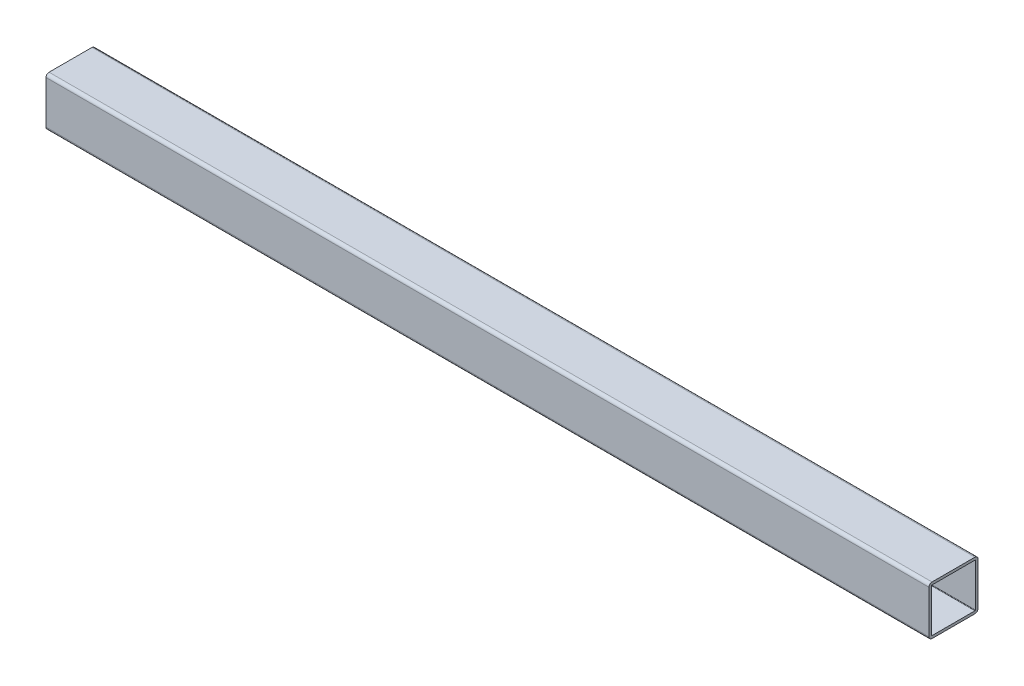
ISO-10303-21;
HEADER;
FILE_DESCRIPTION(('STEP AP214'),'2;1');
FILE_NAME('part.step','',(''),(''),'','','');
FILE_SCHEMA(('AUTOMOTIVE_DESIGN { 1 0 10303 214 1 1 1 1 }'));
ENDSEC;
DATA;
#1=APPLICATION_CONTEXT('core data for automotive mechanical design processes');
#2=APPLICATION_PROTOCOL_DEFINITION('international standard','automotive_design',2000,#1);
#3=PRODUCT_CONTEXT('',#1,'mechanical');
#4=PRODUCT('Part','Part','',(#3));
#5=PRODUCT_RELATED_PRODUCT_CATEGORY('part','',(#4));
#6=PRODUCT_DEFINITION_FORMATION('','',#4);
#7=PRODUCT_DEFINITION_CONTEXT('part definition',#1,'design');
#8=PRODUCT_DEFINITION('design','',#6,#7);
#9=PRODUCT_DEFINITION_SHAPE('','',#8);
#10=(LENGTH_UNIT() NAMED_UNIT(*) SI_UNIT(.MILLI.,.METRE.));
#11=(NAMED_UNIT(*) PLANE_ANGLE_UNIT() SI_UNIT($,.RADIAN.));
#12=(NAMED_UNIT(*) SI_UNIT($,.STERADIAN.) SOLID_ANGLE_UNIT());
#13=UNCERTAINTY_MEASURE_WITH_UNIT(LENGTH_MEASURE(1.E-05),#10,'distance_accuracy_value','');
#14=(GEOMETRIC_REPRESENTATION_CONTEXT(3) GLOBAL_UNCERTAINTY_ASSIGNED_CONTEXT((#13)) GLOBAL_UNIT_ASSIGNED_CONTEXT((#10,
#11,#12)) REPRESENTATION_CONTEXT('',''));
#15=CARTESIAN_POINT('',(0.,0.,0.));
#16=DIRECTION('',(0.,0.,1.));
#17=DIRECTION('',(1.,0.,0.));
#18=AXIS2_PLACEMENT_3D('',#15,#16,#17);
#19=CARTESIAN_POINT('',(457.2,3.65674086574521,-16.8519621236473));
#20=DIRECTION('',(-1.,0.,0.));
#21=DIRECTION('',(0.,0.,1.));
#22=AXIS2_PLACEMENT_3D('',#19,#20,#21);
#23=PLANE('',#22);
#24=CARTESIAN_POINT('',(457.2,3.65674086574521,-16.8519621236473));
#25=DIRECTION('',(1.,0.,0.));
#26=DIRECTION('',(0.,0.,1.));
#27=AXIS2_PLACEMENT_3D('',#24,#25,#26);
#28=CIRCLE('',#27,1.5875);
#29=CARTESIAN_POINT('',(457.2,3.6567408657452,-18.4394621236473));
#30=VERTEX_POINT('',#29);
#31=CARTESIAN_POINT('',(457.2,5.24424086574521,-16.8519621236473));
#32=VERTEX_POINT('',#31);
#33=EDGE_CURVE('E211',#30,#32,#28,.T.);
#34=ORIENTED_EDGE('',*,*,#33,.T.);
#35=DIRECTION('',(0.,0.,1.));
#36=VECTOR('',#35,1.);
#37=CARTESIAN_POINT('',(457.2,5.24424086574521,5.37303787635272));
#38=LINE('',#37,#36);
#39=CARTESIAN_POINT('',(457.2,5.24424086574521,5.37303787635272));
#40=VERTEX_POINT('',#39);
#41=EDGE_CURVE('E214',#32,#40,#38,.T.);
#42=ORIENTED_EDGE('',*,*,#41,.T.);
#43=CARTESIAN_POINT('',(457.2,3.65674086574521,5.37303787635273));
#44=DIRECTION('',(1.,0.,0.));
#45=DIRECTION('',(0.,0.,1.));
#46=AXIS2_PLACEMENT_3D('',#43,#44,#45);
#47=CIRCLE('',#46,1.5875);
#48=CARTESIAN_POINT('',(457.2,3.6567408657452,6.96053787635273));
#49=VERTEX_POINT('',#48);
#50=EDGE_CURVE('E217',#40,#49,#47,.T.);
#51=ORIENTED_EDGE('',*,*,#50,.T.);
#52=DIRECTION('',(0.,-1.,0.));
#53=VECTOR('',#52,1.);
#54=CARTESIAN_POINT('',(457.2,3.6567408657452,6.96053787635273));
#55=LINE('',#54,#53);
#56=CARTESIAN_POINT('',(457.2,-18.5682591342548,6.96053787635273));
#57=VERTEX_POINT('',#56);
#58=EDGE_CURVE('E219',#49,#57,#55,.T.);
#59=ORIENTED_EDGE('',*,*,#58,.T.);
#60=CARTESIAN_POINT('',(457.2,-18.5682591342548,5.37303787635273));
#61=DIRECTION('',(1.,0.,0.));
#62=DIRECTION('',(0.,0.,1.));
#63=AXIS2_PLACEMENT_3D('',#60,#61,#62);
#64=CIRCLE('',#63,1.5875);
#65=CARTESIAN_POINT('',(457.2,-20.1557591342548,5.37303787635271));
#66=VERTEX_POINT('',#65);
#67=EDGE_CURVE('E221',#57,#66,#64,.T.);
#68=ORIENTED_EDGE('',*,*,#67,.T.);
#69=DIRECTION('',(0.,0.,-1.));
#70=VECTOR('',#69,1.);
#71=CARTESIAN_POINT('',(457.2,-20.1557591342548,5.37303787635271));
#72=LINE('',#71,#70);
#73=CARTESIAN_POINT('',(457.2,-20.1557591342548,-16.8519621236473));
#74=VERTEX_POINT('',#73);
#75=EDGE_CURVE('E223',#66,#74,#72,.T.);
#76=ORIENTED_EDGE('',*,*,#75,.T.);
#77=CARTESIAN_POINT('',(457.2,-18.5682591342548,-16.8519621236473));
#78=DIRECTION('',(1.,0.,0.));
#79=DIRECTION('',(0.,0.,1.));
#80=AXIS2_PLACEMENT_3D('',#77,#78,#79);
#81=CIRCLE('',#80,1.5875);
#82=CARTESIAN_POINT('',(457.2,-18.5682591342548,-18.4394621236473));
#83=VERTEX_POINT('',#82);
#84=EDGE_CURVE('E225',#74,#83,#81,.T.);
#85=ORIENTED_EDGE('',*,*,#84,.T.);
#86=DIRECTION('',(0.,1.,0.));
#87=VECTOR('',#86,1.);
#88=CARTESIAN_POINT('',(457.2,3.6567408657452,-18.4394621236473));
#89=LINE('',#88,#87);
#90=EDGE_CURVE('E227',#83,#30,#89,.T.);
#91=ORIENTED_EDGE('',*,*,#90,.T.);
#92=EDGE_LOOP('',(#34,#42,#51,#59,#68,#76,#85,#91));
#93=FACE_BOUND('',#92,.T.);
#94=CARTESIAN_POINT('',(457.2,3.65674086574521,5.37303787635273));
#95=DIRECTION('',(1.,0.,0.));
#96=DIRECTION('',(0.,0.,1.));
#97=AXIS2_PLACEMENT_3D('',#94,#95,#96);
#98=CIRCLE('',#97,0.2413);
#99=CARTESIAN_POINT('',(457.2,3.89804086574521,5.37303787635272));
#100=VERTEX_POINT('',#99);
#101=CARTESIAN_POINT('',(457.2,3.6567408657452,5.61433787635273));
#102=VERTEX_POINT('',#101);
#103=EDGE_CURVE('E146',#100,#102,#98,.T.);
#104=ORIENTED_EDGE('',*,*,#103,.F.);
#105=DIRECTION('',(0.,0.,1.));
#106=VECTOR('',#105,1.);
#107=CARTESIAN_POINT('',(457.2,3.89804086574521,5.37303787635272));
#108=LINE('',#107,#106);
#109=CARTESIAN_POINT('',(457.2,3.89804086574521,-16.8519621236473));
#110=VERTEX_POINT('',#109);
#111=EDGE_CURVE('E179',#110,#100,#108,.T.);
#112=ORIENTED_EDGE('',*,*,#111,.F.);
#113=CARTESIAN_POINT('',(457.2,3.65674086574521,-16.8519621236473));
#114=DIRECTION('',(1.,0.,0.));
#115=DIRECTION('',(0.,0.,1.));
#116=AXIS2_PLACEMENT_3D('',#113,#114,#115);
#117=CIRCLE('',#116,0.2413);
#118=CARTESIAN_POINT('',(457.2,3.65674086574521,-17.0932621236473));
#119=VERTEX_POINT('',#118);
#120=EDGE_CURVE('E177',#119,#110,#117,.T.);
#121=ORIENTED_EDGE('',*,*,#120,.F.);
#122=DIRECTION('',(0.,1.,0.));
#123=VECTOR('',#122,1.);
#124=CARTESIAN_POINT('',(457.2,3.65674086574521,-17.0932621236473));
#125=LINE('',#124,#123);
#126=CARTESIAN_POINT('',(457.2,-18.5682591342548,-17.0932621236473));
#127=VERTEX_POINT('',#126);
#128=EDGE_CURVE('E175',#127,#119,#125,.T.);
#129=ORIENTED_EDGE('',*,*,#128,.F.);
#130=CARTESIAN_POINT('',(457.2,-18.5682591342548,-16.8519621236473));
#131=DIRECTION('',(1.,0.,0.));
#132=DIRECTION('',(0.,0.,1.));
#133=AXIS2_PLACEMENT_3D('',#130,#131,#132);
#134=CIRCLE('',#133,0.241299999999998);
#135=CARTESIAN_POINT('',(457.2,-18.8095591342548,-16.8519621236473));
#136=VERTEX_POINT('',#135);
#137=EDGE_CURVE('E173',#136,#127,#134,.T.);
#138=ORIENTED_EDGE('',*,*,#137,.F.);
#139=DIRECTION('',(0.,0.,-1.));
#140=VECTOR('',#139,1.);
#141=CARTESIAN_POINT('',(457.2,-18.8095591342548,5.37303787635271));
#142=LINE('',#141,#140);
#143=CARTESIAN_POINT('',(457.2,-18.8095591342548,5.37303787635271));
#144=VERTEX_POINT('',#143);
#145=EDGE_CURVE('E169',#144,#136,#142,.T.);
#146=ORIENTED_EDGE('',*,*,#145,.F.);
#147=CARTESIAN_POINT('',(457.2,-18.5682591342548,5.37303787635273));
#148=DIRECTION('',(1.,0.,0.));
#149=DIRECTION('',(0.,0.,1.));
#150=AXIS2_PLACEMENT_3D('',#147,#148,#149);
#151=CIRCLE('',#150,0.241299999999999);
#152=CARTESIAN_POINT('',(457.2,-18.5682591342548,5.61433787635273));
#153=VERTEX_POINT('',#152);
#154=EDGE_CURVE('E167',#153,#144,#151,.T.);
#155=ORIENTED_EDGE('',*,*,#154,.F.);
#156=DIRECTION('',(0.,-1.,0.));
#157=VECTOR('',#156,1.);
#158=CARTESIAN_POINT('',(457.2,3.6567408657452,5.61433787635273));
#159=LINE('',#158,#157);
#160=EDGE_CURVE('E154',#102,#153,#159,.T.);
#161=ORIENTED_EDGE('',*,*,#160,.F.);
#162=EDGE_LOOP('',(#104,#112,#121,#129,#138,#146,#155,#161));
#163=FACE_BOUND('',#162,.T.);
#164=ADVANCED_FACE('F33',(#93,#163),#23,.F.);
#165=CARTESIAN_POINT('',(0.,3.65674086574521,-16.8519621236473));
#166=DIRECTION('',(-1.,0.,0.));
#167=DIRECTION('',(0.,0.,1.));
#168=AXIS2_PLACEMENT_3D('',#165,#166,#167);
#169=PLANE('',#168);
#170=CARTESIAN_POINT('',(0.,3.65674086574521,-16.8519621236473));
#171=DIRECTION('',(1.,0.,0.));
#172=DIRECTION('',(0.,0.,1.));
#173=AXIS2_PLACEMENT_3D('',#170,#171,#172);
#174=CIRCLE('',#173,1.5875);
#175=CARTESIAN_POINT('',(0.,3.6567408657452,-18.4394621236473));
#176=VERTEX_POINT('',#175);
#177=CARTESIAN_POINT('',(0.,5.24424086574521,-16.8519621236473));
#178=VERTEX_POINT('',#177);
#179=EDGE_CURVE('E162',#176,#178,#174,.T.);
#180=ORIENTED_EDGE('',*,*,#179,.F.);
#181=DIRECTION('',(0.,1.,0.));
#182=VECTOR('',#181,1.);
#183=CARTESIAN_POINT('',(0.,3.6567408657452,-18.4394621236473));
#184=LINE('',#183,#182);
#185=CARTESIAN_POINT('',(0.,-18.5682591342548,-18.4394621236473));
#186=VERTEX_POINT('',#185);
#187=EDGE_CURVE('E215',#186,#176,#184,.T.);
#188=ORIENTED_EDGE('',*,*,#187,.F.);
#189=CARTESIAN_POINT('',(0.,-18.5682591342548,-16.8519621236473));
#190=DIRECTION('',(1.,0.,0.));
#191=DIRECTION('',(0.,0.,1.));
#192=AXIS2_PLACEMENT_3D('',#189,#190,#191);
#193=CIRCLE('',#192,1.5875);
#194=CARTESIAN_POINT('',(0.,-20.1557591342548,-16.8519621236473));
#195=VERTEX_POINT('',#194);
#196=EDGE_CURVE('E242',#195,#186,#193,.T.);
#197=ORIENTED_EDGE('',*,*,#196,.F.);
#198=DIRECTION('',(0.,0.,-1.));
#199=VECTOR('',#198,1.);
#200=CARTESIAN_POINT('',(0.,-20.1557591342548,5.37303787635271));
#201=LINE('',#200,#199);
#202=CARTESIAN_POINT('',(0.,-20.1557591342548,5.37303787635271));
#203=VERTEX_POINT('',#202);
#204=EDGE_CURVE('E240',#203,#195,#201,.T.);
#205=ORIENTED_EDGE('',*,*,#204,.F.);
#206=CARTESIAN_POINT('',(0.,-18.5682591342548,5.37303787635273));
#207=DIRECTION('',(1.,0.,0.));
#208=DIRECTION('',(0.,0.,1.));
#209=AXIS2_PLACEMENT_3D('',#206,#207,#208);
#210=CIRCLE('',#209,1.5875);
#211=CARTESIAN_POINT('',(0.,-18.5682591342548,6.96053787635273));
#212=VERTEX_POINT('',#211);
#213=EDGE_CURVE('E238',#212,#203,#210,.T.);
#214=ORIENTED_EDGE('',*,*,#213,.F.);
#215=DIRECTION('',(0.,-1.,0.));
#216=VECTOR('',#215,1.);
#217=CARTESIAN_POINT('',(0.,3.6567408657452,6.96053787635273));
#218=LINE('',#217,#216);
#219=CARTESIAN_POINT('',(0.,3.6567408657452,6.96053787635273));
#220=VERTEX_POINT('',#219);
#221=EDGE_CURVE('E236',#220,#212,#218,.T.);
#222=ORIENTED_EDGE('',*,*,#221,.F.);
#223=CARTESIAN_POINT('',(0.,3.65674086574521,5.37303787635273));
#224=DIRECTION('',(1.,0.,0.));
#225=DIRECTION('',(0.,0.,1.));
#226=AXIS2_PLACEMENT_3D('',#223,#224,#225);
#227=CIRCLE('',#226,1.5875);
#228=CARTESIAN_POINT('',(0.,5.24424086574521,5.37303787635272));
#229=VERTEX_POINT('',#228);
#230=EDGE_CURVE('E234',#229,#220,#227,.T.);
#231=ORIENTED_EDGE('',*,*,#230,.F.);
#232=DIRECTION('',(0.,0.,1.));
#233=VECTOR('',#232,1.);
#234=CARTESIAN_POINT('',(0.,5.24424086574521,5.37303787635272));
#235=LINE('',#234,#233);
#236=EDGE_CURVE('E232',#178,#229,#235,.T.);
#237=ORIENTED_EDGE('',*,*,#236,.F.);
#238=EDGE_LOOP('',(#180,#188,#197,#205,#214,#222,#231,#237));
#239=FACE_BOUND('',#238,.T.);
#240=DIRECTION('',(0.,0.,1.));
#241=VECTOR('',#240,1.);
#242=CARTESIAN_POINT('',(0.,3.89804086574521,5.37303787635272));
#243=LINE('',#242,#241);
#244=CARTESIAN_POINT('',(0.,3.89804086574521,-16.8519621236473));
#245=VERTEX_POINT('',#244);
#246=CARTESIAN_POINT('',(0.,3.89804086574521,5.37303787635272));
#247=VERTEX_POINT('',#246);
#248=EDGE_CURVE('E155',#245,#247,#243,.T.);
#249=ORIENTED_EDGE('',*,*,#248,.T.);
#250=CARTESIAN_POINT('',(0.,3.65674086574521,5.37303787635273));
#251=DIRECTION('',(1.,0.,0.));
#252=DIRECTION('',(0.,0.,1.));
#253=AXIS2_PLACEMENT_3D('',#250,#251,#252);
#254=CIRCLE('',#253,0.2413);
#255=CARTESIAN_POINT('',(0.,3.6567408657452,5.61433787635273));
#256=VERTEX_POINT('',#255);
#257=EDGE_CURVE('E56',#247,#256,#254,.T.);
#258=ORIENTED_EDGE('',*,*,#257,.T.);
#259=DIRECTION('',(0.,-1.,0.));
#260=VECTOR('',#259,1.);
#261=CARTESIAN_POINT('',(0.,3.6567408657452,5.61433787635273));
#262=LINE('',#261,#260);
#263=CARTESIAN_POINT('',(0.,-18.5682591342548,5.61433787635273));
#264=VERTEX_POINT('',#263);
#265=EDGE_CURVE('E161',#256,#264,#262,.T.);
#266=ORIENTED_EDGE('',*,*,#265,.T.);
#267=CARTESIAN_POINT('',(0.,-18.5682591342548,5.37303787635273));
#268=DIRECTION('',(1.,0.,0.));
#269=DIRECTION('',(0.,0.,1.));
#270=AXIS2_PLACEMENT_3D('',#267,#268,#269);
#271=CIRCLE('',#270,0.241299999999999);
#272=CARTESIAN_POINT('',(0.,-18.8095591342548,5.37303787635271));
#273=VERTEX_POINT('',#272);
#274=EDGE_CURVE('E183',#264,#273,#271,.T.);
#275=ORIENTED_EDGE('',*,*,#274,.T.);
#276=DIRECTION('',(0.,0.,-1.));
#277=VECTOR('',#276,1.);
#278=CARTESIAN_POINT('',(0.,-18.8095591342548,5.37303787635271));
#279=LINE('',#278,#277);
#280=CARTESIAN_POINT('',(0.,-18.8095591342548,-16.8519621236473));
#281=VERTEX_POINT('',#280);
#282=EDGE_CURVE('E186',#273,#281,#279,.T.);
#283=ORIENTED_EDGE('',*,*,#282,.T.);
#284=CARTESIAN_POINT('',(0.,-18.5682591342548,-16.8519621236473));
#285=DIRECTION('',(1.,0.,0.));
#286=DIRECTION('',(0.,0.,1.));
#287=AXIS2_PLACEMENT_3D('',#284,#285,#286);
#288=CIRCLE('',#287,0.241299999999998);
#289=CARTESIAN_POINT('',(0.,-18.5682591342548,-17.0932621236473));
#290=VERTEX_POINT('',#289);
#291=EDGE_CURVE('E189',#281,#290,#288,.T.);
#292=ORIENTED_EDGE('',*,*,#291,.T.);
#293=DIRECTION('',(0.,1.,0.));
#294=VECTOR('',#293,1.);
#295=CARTESIAN_POINT('',(0.,3.65674086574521,-17.0932621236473));
#296=LINE('',#295,#294);
#297=CARTESIAN_POINT('',(0.,3.65674086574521,-17.0932621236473));
#298=VERTEX_POINT('',#297);
#299=EDGE_CURVE('E192',#290,#298,#296,.T.);
#300=ORIENTED_EDGE('',*,*,#299,.T.);
#301=CARTESIAN_POINT('',(0.,3.65674086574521,-16.8519621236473));
#302=DIRECTION('',(1.,0.,0.));
#303=DIRECTION('',(0.,0.,1.));
#304=AXIS2_PLACEMENT_3D('',#301,#302,#303);
#305=CIRCLE('',#304,0.2413);
#306=EDGE_CURVE('E195',#298,#245,#305,.T.);
#307=ORIENTED_EDGE('',*,*,#306,.T.);
#308=EDGE_LOOP('',(#249,#258,#266,#275,#283,#292,#300,#307));
#309=FACE_BOUND('',#308,.T.);
#310=ADVANCED_FACE('F272',(#239,#309),#169,.T.);
#311=CARTESIAN_POINT('',(457.2,3.65674086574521,-16.8519621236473));
#312=DIRECTION('',(-1.,0.,0.));
#313=DIRECTION('',(0.,0.,1.));
#314=AXIS2_PLACEMENT_3D('',#311,#312,#313);
#315=CYLINDRICAL_SURFACE('',#314,1.5875);
#316=ORIENTED_EDGE('',*,*,#179,.T.);
#317=DIRECTION('',(-1.,0.,0.));
#318=VECTOR('',#317,1.);
#319=CARTESIAN_POINT('',(457.2,5.24424086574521,-16.8519621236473));
#320=LINE('',#319,#318);
#321=EDGE_CURVE('E11',#32,#178,#320,.T.);
#322=ORIENTED_EDGE('',*,*,#321,.F.);
#323=ORIENTED_EDGE('',*,*,#33,.F.);
#324=DIRECTION('',(-1.,0.,0.));
#325=VECTOR('',#324,1.);
#326=CARTESIAN_POINT('',(457.2,3.6567408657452,-18.4394621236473));
#327=LINE('',#326,#325);
#328=EDGE_CURVE('E229',#30,#176,#327,.T.);
#329=ORIENTED_EDGE('',*,*,#328,.T.);
#330=EDGE_LOOP('',(#316,#322,#323,#329));
#331=FACE_BOUND('',#330,.T.);
#332=ADVANCED_FACE('F35',(#331),#315,.T.);
#333=CARTESIAN_POINT('',(457.2,5.24424086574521,5.37303787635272));
#334=DIRECTION('',(0.,-1.,0.));
#335=DIRECTION('',(0.,0.,-1.));
#336=AXIS2_PLACEMENT_3D('',#333,#334,#335);
#337=PLANE('',#336);
#338=ORIENTED_EDGE('',*,*,#236,.T.);
#339=DIRECTION('',(-1.,0.,0.));
#340=VECTOR('',#339,1.);
#341=CARTESIAN_POINT('',(457.2,5.24424086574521,5.37303787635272));
#342=LINE('',#341,#340);
#343=EDGE_CURVE('E41',#40,#229,#342,.T.);
#344=ORIENTED_EDGE('',*,*,#343,.F.);
#345=ORIENTED_EDGE('',*,*,#41,.F.);
#346=ORIENTED_EDGE('',*,*,#321,.T.);
#347=EDGE_LOOP('',(#338,#344,#345,#346));
#348=FACE_BOUND('',#347,.T.);
#349=ADVANCED_FACE('F289',(#348),#337,.F.);
#350=CARTESIAN_POINT('',(457.2,3.65674086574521,5.37303787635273));
#351=DIRECTION('',(-1.,0.,0.));
#352=DIRECTION('',(0.,0.,1.));
#353=AXIS2_PLACEMENT_3D('',#350,#351,#352);
#354=CYLINDRICAL_SURFACE('',#353,1.5875);
#355=ORIENTED_EDGE('',*,*,#230,.T.);
#356=DIRECTION('',(-1.,0.,0.));
#357=VECTOR('',#356,1.);
#358=CARTESIAN_POINT('',(457.2,3.6567408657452,6.96053787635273));
#359=LINE('',#358,#357);
#360=EDGE_CURVE('E259',#49,#220,#359,.T.);
#361=ORIENTED_EDGE('',*,*,#360,.F.);
#362=ORIENTED_EDGE('',*,*,#50,.F.);
#363=ORIENTED_EDGE('',*,*,#343,.T.);
#364=EDGE_LOOP('',(#355,#361,#362,#363));
#365=FACE_BOUND('',#364,.T.);
#366=ADVANCED_FACE('F266',(#365),#354,.T.);
#367=CARTESIAN_POINT('',(457.2,3.6567408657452,6.96053787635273));
#368=DIRECTION('',(0.,0.,-1.));
#369=DIRECTION('',(0.,1.,0.));
#370=AXIS2_PLACEMENT_3D('',#367,#368,#369);
#371=PLANE('',#370);
#372=ORIENTED_EDGE('',*,*,#221,.T.);
#373=DIRECTION('',(-1.,0.,0.));
#374=VECTOR('',#373,1.);
#375=CARTESIAN_POINT('',(457.2,-18.5682591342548,6.96053787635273));
#376=LINE('',#375,#374);
#377=EDGE_CURVE('E256',#57,#212,#376,.T.);
#378=ORIENTED_EDGE('',*,*,#377,.F.);
#379=ORIENTED_EDGE('',*,*,#58,.F.);
#380=ORIENTED_EDGE('',*,*,#360,.T.);
#381=EDGE_LOOP('',(#372,#378,#379,#380));
#382=FACE_BOUND('',#381,.T.);
#383=ADVANCED_FACE('F278',(#382),#371,.F.);
#384=CARTESIAN_POINT('',(457.2,-18.5682591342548,5.37303787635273));
#385=DIRECTION('',(-1.,0.,0.));
#386=DIRECTION('',(0.,0.,1.));
#387=AXIS2_PLACEMENT_3D('',#384,#385,#386);
#388=CYLINDRICAL_SURFACE('',#387,1.5875);
#389=ORIENTED_EDGE('',*,*,#213,.T.);
#390=DIRECTION('',(-1.,0.,0.));
#391=VECTOR('',#390,1.);
#392=CARTESIAN_POINT('',(457.2,-20.1557591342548,5.37303787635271));
#393=LINE('',#392,#391);
#394=EDGE_CURVE('E253',#66,#203,#393,.T.);
#395=ORIENTED_EDGE('',*,*,#394,.F.);
#396=ORIENTED_EDGE('',*,*,#67,.F.);
#397=ORIENTED_EDGE('',*,*,#377,.T.);
#398=EDGE_LOOP('',(#389,#395,#396,#397));
#399=FACE_BOUND('',#398,.T.);
#400=ADVANCED_FACE('F282',(#399),#388,.T.);
#401=CARTESIAN_POINT('',(457.2,-20.1557591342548,5.37303787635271));
#402=DIRECTION('',(0.,1.,0.));
#403=DIRECTION('',(0.,0.,1.));
#404=AXIS2_PLACEMENT_3D('',#401,#402,#403);
#405=PLANE('',#404);
#406=ORIENTED_EDGE('',*,*,#204,.T.);
#407=DIRECTION('',(-1.,0.,0.));
#408=VECTOR('',#407,1.);
#409=CARTESIAN_POINT('',(457.2,-20.1557591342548,-16.8519621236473));
#410=LINE('',#409,#408);
#411=EDGE_CURVE('E250',#74,#195,#410,.T.);
#412=ORIENTED_EDGE('',*,*,#411,.F.);
#413=ORIENTED_EDGE('',*,*,#75,.F.);
#414=ORIENTED_EDGE('',*,*,#394,.T.);
#415=EDGE_LOOP('',(#406,#412,#413,#414));
#416=FACE_BOUND('',#415,.T.);
#417=ADVANCED_FACE('F302',(#416),#405,.F.);
#418=CARTESIAN_POINT('',(457.2,-18.5682591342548,-16.8519621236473));
#419=DIRECTION('',(-1.,0.,0.));
#420=DIRECTION('',(0.,0.,1.));
#421=AXIS2_PLACEMENT_3D('',#418,#419,#420);
#422=CYLINDRICAL_SURFACE('',#421,1.5875);
#423=ORIENTED_EDGE('',*,*,#196,.T.);
#424=DIRECTION('',(-1.,0.,0.));
#425=VECTOR('',#424,1.);
#426=CARTESIAN_POINT('',(457.2,-18.5682591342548,-18.4394621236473));
#427=LINE('',#426,#425);
#428=EDGE_CURVE('E247',#83,#186,#427,.T.);
#429=ORIENTED_EDGE('',*,*,#428,.F.);
#430=ORIENTED_EDGE('',*,*,#84,.F.);
#431=ORIENTED_EDGE('',*,*,#411,.T.);
#432=EDGE_LOOP('',(#423,#429,#430,#431));
#433=FACE_BOUND('',#432,.T.);
#434=ADVANCED_FACE('F300',(#433),#422,.T.);
#435=CARTESIAN_POINT('',(457.2,3.6567408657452,-18.4394621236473));
#436=DIRECTION('',(0.,0.,1.));
#437=DIRECTION('',(0.,-1.,0.));
#438=AXIS2_PLACEMENT_3D('',#435,#436,#437);
#439=PLANE('',#438);
#440=ORIENTED_EDGE('',*,*,#187,.T.);
#441=ORIENTED_EDGE('',*,*,#328,.F.);
#442=ORIENTED_EDGE('',*,*,#90,.F.);
#443=ORIENTED_EDGE('',*,*,#428,.T.);
#444=EDGE_LOOP('',(#440,#441,#442,#443));
#445=FACE_BOUND('',#444,.T.);
#446=ADVANCED_FACE('F295',(#445),#439,.F.);
#447=CARTESIAN_POINT('',(457.2,3.65674086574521,5.37303787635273));
#448=DIRECTION('',(-1.,0.,0.));
#449=DIRECTION('',(0.,0.,1.));
#450=AXIS2_PLACEMENT_3D('',#447,#448,#449);
#451=CYLINDRICAL_SURFACE('',#450,0.2413);
#452=ORIENTED_EDGE('',*,*,#257,.F.);
#453=DIRECTION('',(-1.,0.,0.));
#454=VECTOR('',#453,1.);
#455=CARTESIAN_POINT('',(457.2,3.89804086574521,5.37303787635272));
#456=LINE('',#455,#454);
#457=EDGE_CURVE('E150',#100,#247,#456,.T.);
#458=ORIENTED_EDGE('',*,*,#457,.F.);
#459=ORIENTED_EDGE('',*,*,#103,.T.);
#460=DIRECTION('',(-1.,0.,0.));
#461=VECTOR('',#460,1.);
#462=CARTESIAN_POINT('',(457.2,3.6567408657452,5.61433787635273));
#463=LINE('',#462,#461);
#464=EDGE_CURVE('E149',#102,#256,#463,.T.);
#465=ORIENTED_EDGE('',*,*,#464,.T.);
#466=EDGE_LOOP('',(#452,#458,#459,#465));
#467=FACE_BOUND('',#466,.T.);
#468=ADVANCED_FACE('F148',(#467),#451,.F.);
#469=CARTESIAN_POINT('',(457.2,3.6567408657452,5.61433787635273));
#470=DIRECTION('',(0.,0.,-1.));
#471=DIRECTION('',(0.,1.,0.));
#472=AXIS2_PLACEMENT_3D('',#469,#470,#471);
#473=PLANE('',#472);
#474=ORIENTED_EDGE('',*,*,#265,.F.);
#475=ORIENTED_EDGE('',*,*,#464,.F.);
#476=ORIENTED_EDGE('',*,*,#160,.T.);
#477=DIRECTION('',(-1.,0.,0.));
#478=VECTOR('',#477,1.);
#479=CARTESIAN_POINT('',(457.2,-18.5682591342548,5.61433787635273));
#480=LINE('',#479,#478);
#481=EDGE_CURVE('E163',#153,#264,#480,.T.);
#482=ORIENTED_EDGE('',*,*,#481,.T.);
#483=EDGE_LOOP('',(#474,#475,#476,#482));
#484=FACE_BOUND('',#483,.T.);
#485=ADVANCED_FACE('F158',(#484),#473,.T.);
#486=CARTESIAN_POINT('',(457.2,-18.5682591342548,5.37303787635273));
#487=DIRECTION('',(-1.,0.,0.));
#488=DIRECTION('',(0.,0.,1.));
#489=AXIS2_PLACEMENT_3D('',#486,#487,#488);
#490=CYLINDRICAL_SURFACE('',#489,0.241299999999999);
#491=ORIENTED_EDGE('',*,*,#274,.F.);
#492=ORIENTED_EDGE('',*,*,#481,.F.);
#493=ORIENTED_EDGE('',*,*,#154,.T.);
#494=DIRECTION('',(-1.,0.,0.));
#495=VECTOR('',#494,1.);
#496=CARTESIAN_POINT('',(457.2,-18.8095591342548,5.37303787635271));
#497=LINE('',#496,#495);
#498=EDGE_CURVE('E208',#144,#273,#497,.T.);
#499=ORIENTED_EDGE('',*,*,#498,.T.);
#500=EDGE_LOOP('',(#491,#492,#493,#499));
#501=FACE_BOUND('',#500,.T.);
#502=ADVANCED_FACE('F327',(#501),#490,.F.);
#503=CARTESIAN_POINT('',(457.2,-18.8095591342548,5.37303787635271));
#504=DIRECTION('',(0.,1.,0.));
#505=DIRECTION('',(0.,0.,1.));
#506=AXIS2_PLACEMENT_3D('',#503,#504,#505);
#507=PLANE('',#506);
#508=ORIENTED_EDGE('',*,*,#282,.F.);
#509=ORIENTED_EDGE('',*,*,#498,.F.);
#510=ORIENTED_EDGE('',*,*,#145,.T.);
#511=DIRECTION('',(-1.,0.,0.));
#512=VECTOR('',#511,1.);
#513=CARTESIAN_POINT('',(457.2,-18.8095591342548,-16.8519621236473));
#514=LINE('',#513,#512);
#515=EDGE_CURVE('E206',#136,#281,#514,.T.);
#516=ORIENTED_EDGE('',*,*,#515,.T.);
#517=EDGE_LOOP('',(#508,#509,#510,#516));
#518=FACE_BOUND('',#517,.T.);
#519=ADVANCED_FACE('F331',(#518),#507,.T.);
#520=CARTESIAN_POINT('',(457.2,-18.5682591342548,-16.8519621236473));
#521=DIRECTION('',(-1.,0.,0.));
#522=DIRECTION('',(0.,0.,1.));
#523=AXIS2_PLACEMENT_3D('',#520,#521,#522);
#524=CYLINDRICAL_SURFACE('',#523,0.241299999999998);
#525=ORIENTED_EDGE('',*,*,#291,.F.);
#526=ORIENTED_EDGE('',*,*,#515,.F.);
#527=ORIENTED_EDGE('',*,*,#137,.T.);
#528=DIRECTION('',(-1.,0.,0.));
#529=VECTOR('',#528,1.);
#530=CARTESIAN_POINT('',(457.2,-18.5682591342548,-17.0932621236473));
#531=LINE('',#530,#529);
#532=EDGE_CURVE('E204',#127,#290,#531,.T.);
#533=ORIENTED_EDGE('',*,*,#532,.T.);
#534=EDGE_LOOP('',(#525,#526,#527,#533));
#535=FACE_BOUND('',#534,.T.);
#536=ADVANCED_FACE('F337',(#535),#524,.F.);
#537=CARTESIAN_POINT('',(457.2,3.65674086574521,-17.0932621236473));
#538=DIRECTION('',(0.,0.,1.));
#539=DIRECTION('',(1.,0.,0.));
#540=AXIS2_PLACEMENT_3D('',#537,#538,#539);
#541=PLANE('',#540);
#542=ORIENTED_EDGE('',*,*,#299,.F.);
#543=ORIENTED_EDGE('',*,*,#532,.F.);
#544=ORIENTED_EDGE('',*,*,#128,.T.);
#545=DIRECTION('',(-1.,0.,0.));
#546=VECTOR('',#545,1.);
#547=CARTESIAN_POINT('',(457.2,3.65674086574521,-17.0932621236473));
#548=LINE('',#547,#546);
#549=EDGE_CURVE('E202',#119,#298,#548,.T.);
#550=ORIENTED_EDGE('',*,*,#549,.T.);
#551=EDGE_LOOP('',(#542,#543,#544,#550));
#552=FACE_BOUND('',#551,.T.);
#553=ADVANCED_FACE('F341',(#552),#541,.T.);
#554=CARTESIAN_POINT('',(457.2,3.65674086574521,-16.8519621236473));
#555=DIRECTION('',(-1.,0.,0.));
#556=DIRECTION('',(0.,0.,1.));
#557=AXIS2_PLACEMENT_3D('',#554,#555,#556);
#558=CYLINDRICAL_SURFACE('',#557,0.2413);
#559=ORIENTED_EDGE('',*,*,#306,.F.);
#560=ORIENTED_EDGE('',*,*,#549,.F.);
#561=ORIENTED_EDGE('',*,*,#120,.T.);
#562=DIRECTION('',(-1.,0.,0.));
#563=VECTOR('',#562,1.);
#564=CARTESIAN_POINT('',(457.2,3.89804086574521,-16.8519621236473));
#565=LINE('',#564,#563);
#566=EDGE_CURVE('E48',#110,#245,#565,.T.);
#567=ORIENTED_EDGE('',*,*,#566,.T.);
#568=EDGE_LOOP('',(#559,#560,#561,#567));
#569=FACE_BOUND('',#568,.T.);
#570=ADVANCED_FACE('F345',(#569),#558,.F.);
#571=CARTESIAN_POINT('',(457.2,3.89804086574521,5.37303787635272));
#572=DIRECTION('',(0.,-1.,0.));
#573=DIRECTION('',(0.,0.,-1.));
#574=AXIS2_PLACEMENT_3D('',#571,#572,#573);
#575=PLANE('',#574);
#576=ORIENTED_EDGE('',*,*,#248,.F.);
#577=ORIENTED_EDGE('',*,*,#566,.F.);
#578=ORIENTED_EDGE('',*,*,#111,.T.);
#579=ORIENTED_EDGE('',*,*,#457,.T.);
#580=EDGE_LOOP('',(#576,#577,#578,#579));
#581=FACE_BOUND('',#580,.T.);
#582=ADVANCED_FACE('F349',(#581),#575,.T.);
#583=CLOSED_SHELL('',(#164,#310,#332,#349,#366,#383,#400,#417,#434,#446,#468,#485,#502,#519,
#536,#553,#570,#582));
#584=MANIFOLD_SOLID_BREP('B2',#583);
#585=ADVANCED_BREP_SHAPE_REPRESENTATION('',(#18,#584),#14);
#586=SHAPE_DEFINITION_REPRESENTATION(#9,#585);
ENDSEC;
END-ISO-10303-21;
